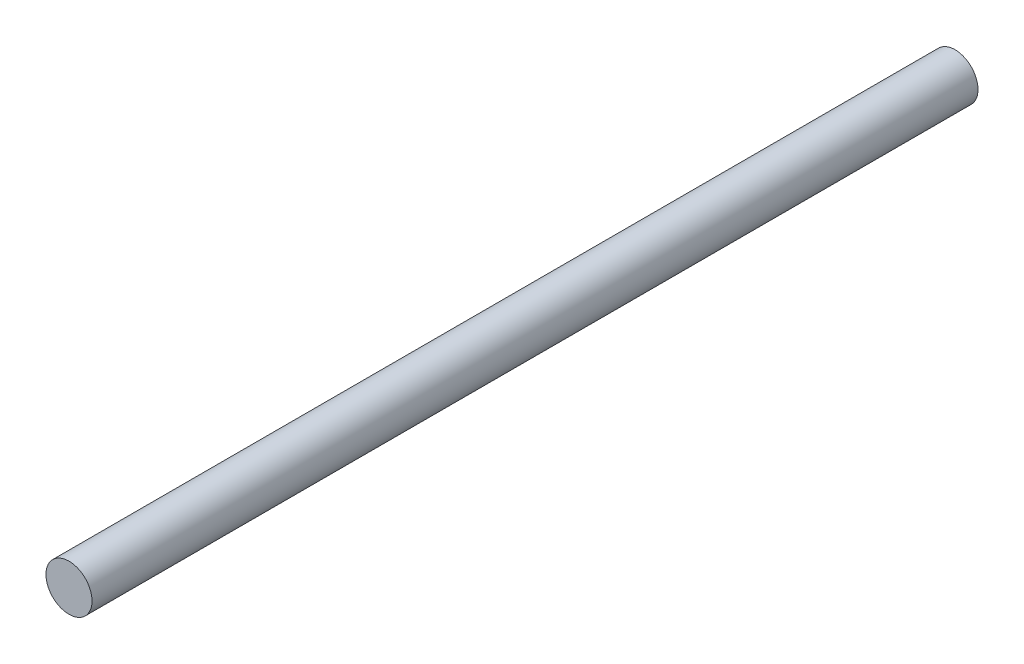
ISO-10303-21;
HEADER;
FILE_DESCRIPTION(('STEP AP214'),'2;1');
FILE_NAME('part.step','',(''),(''),'','','');
FILE_SCHEMA(('AUTOMOTIVE_DESIGN { 1 0 10303 214 1 1 1 1 }'));
ENDSEC;
DATA;
#1=APPLICATION_CONTEXT('core data for automotive mechanical design processes');
#2=APPLICATION_PROTOCOL_DEFINITION('international standard','automotive_design',2000,#1);
#3=PRODUCT_CONTEXT('',#1,'mechanical');
#4=PRODUCT('Part','Part','',(#3));
#5=PRODUCT_RELATED_PRODUCT_CATEGORY('part','',(#4));
#6=PRODUCT_DEFINITION_FORMATION('','',#4);
#7=PRODUCT_DEFINITION_CONTEXT('part definition',#1,'design');
#8=PRODUCT_DEFINITION('design','',#6,#7);
#9=PRODUCT_DEFINITION_SHAPE('','',#8);
#10=(LENGTH_UNIT() NAMED_UNIT(*) SI_UNIT(.MILLI.,.METRE.));
#11=(NAMED_UNIT(*) PLANE_ANGLE_UNIT() SI_UNIT($,.RADIAN.));
#12=(NAMED_UNIT(*) SI_UNIT($,.STERADIAN.) SOLID_ANGLE_UNIT());
#13=UNCERTAINTY_MEASURE_WITH_UNIT(LENGTH_MEASURE(1.E-05),#10,'distance_accuracy_value','');
#14=(GEOMETRIC_REPRESENTATION_CONTEXT(3) GLOBAL_UNCERTAINTY_ASSIGNED_CONTEXT((#13)) GLOBAL_UNIT_ASSIGNED_CONTEXT((#10,
#11,#12)) REPRESENTATION_CONTEXT('',''));
#15=CARTESIAN_POINT('',(0.,0.,0.));
#16=DIRECTION('',(0.,0.,1.));
#17=DIRECTION('',(1.,0.,0.));
#18=AXIS2_PLACEMENT_3D('',#15,#16,#17);
#19=CARTESIAN_POINT('',(-86.9967291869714,-495.578834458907,125.));
#20=DIRECTION('',(0.,0.,-1.));
#21=DIRECTION('',(-1.,0.,0.));
#22=AXIS2_PLACEMENT_3D('',#19,#20,#21);
#23=CYLINDRICAL_SURFACE('',#22,3.25000000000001);
#24=CARTESIAN_POINT('',(-86.9967291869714,-495.578834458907,125.));
#25=DIRECTION('',(0.,0.,1.));
#26=DIRECTION('',(1.,0.,0.));
#27=AXIS2_PLACEMENT_3D('',#24,#25,#26);
#28=CIRCLE('',#27,3.25000000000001);
#29=CARTESIAN_POINT('',(-83.7467291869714,-495.578834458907,125.));
#30=VERTEX_POINT('',#29);
#31=EDGE_CURVE('E10',#30,#30,#28,.T.);
#32=ORIENTED_EDGE('',*,*,#31,.F.);
#33=EDGE_LOOP('',(#32));
#34=FACE_BOUND('',#33,.T.);
#35=CARTESIAN_POINT('',(-86.9967291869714,-495.578834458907,0.));
#36=DIRECTION('',(0.,0.,1.));
#37=DIRECTION('',(1.,0.,0.));
#38=AXIS2_PLACEMENT_3D('',#35,#36,#37);
#39=CIRCLE('',#38,3.25000000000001);
#40=CARTESIAN_POINT('',(-83.7467291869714,-495.578834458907,0.));
#41=VERTEX_POINT('',#40);
#42=EDGE_CURVE('E36',#41,#41,#39,.T.);
#43=ORIENTED_EDGE('',*,*,#42,.T.);
#44=EDGE_LOOP('',(#43));
#45=FACE_BOUND('',#44,.T.);
#46=ADVANCED_FACE('F30',(#34,#45),#23,.T.);
#47=CARTESIAN_POINT('',(-86.9967291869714,-495.578834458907,125.));
#48=DIRECTION('',(0.,0.,1.));
#49=DIRECTION('',(1.,0.,0.));
#50=AXIS2_PLACEMENT_3D('',#47,#48,#49);
#51=PLANE('',#50);
#52=ORIENTED_EDGE('',*,*,#31,.T.);
#53=EDGE_LOOP('',(#52));
#54=FACE_BOUND('',#53,.T.);
#55=ADVANCED_FACE('F45',(#54),#51,.T.);
#56=CARTESIAN_POINT('',(-86.9967291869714,-495.578834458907,0.));
#57=DIRECTION('',(0.,0.,1.));
#58=DIRECTION('',(1.,0.,0.));
#59=AXIS2_PLACEMENT_3D('',#56,#57,#58);
#60=PLANE('',#59);
#61=ORIENTED_EDGE('',*,*,#42,.F.);
#62=EDGE_LOOP('',(#61));
#63=FACE_BOUND('',#62,.T.);
#64=ADVANCED_FACE('F43',(#63),#60,.F.);
#65=CLOSED_SHELL('',(#46,#55,#64));
#66=MANIFOLD_SOLID_BREP('B2',#65);
#67=ADVANCED_BREP_SHAPE_REPRESENTATION('',(#18,#66),#14);
#68=SHAPE_DEFINITION_REPRESENTATION(#9,#67);
ENDSEC;
END-ISO-10303-21;
